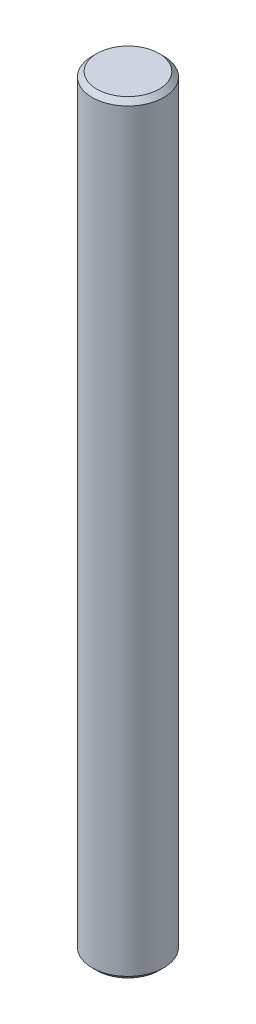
ISO-10303-21;
HEADER;
FILE_DESCRIPTION(('STEP AP214'),'2;1');
FILE_NAME('part.step','',(''),(''),'','','');
FILE_SCHEMA(('AUTOMOTIVE_DESIGN { 1 0 10303 214 1 1 1 1 }'));
ENDSEC;
DATA;
#1=APPLICATION_CONTEXT('core data for automotive mechanical design processes');
#2=APPLICATION_PROTOCOL_DEFINITION('international standard','automotive_design',2000,#1);
#3=PRODUCT_CONTEXT('',#1,'mechanical');
#4=PRODUCT('Part','Part','',(#3));
#5=PRODUCT_RELATED_PRODUCT_CATEGORY('part','',(#4));
#6=PRODUCT_DEFINITION_FORMATION('','',#4);
#7=PRODUCT_DEFINITION_CONTEXT('part definition',#1,'design');
#8=PRODUCT_DEFINITION('design','',#6,#7);
#9=PRODUCT_DEFINITION_SHAPE('','',#8);
#10=(LENGTH_UNIT() NAMED_UNIT(*) SI_UNIT(.MILLI.,.METRE.));
#11=(NAMED_UNIT(*) PLANE_ANGLE_UNIT() SI_UNIT($,.RADIAN.));
#12=(NAMED_UNIT(*) SI_UNIT($,.STERADIAN.) SOLID_ANGLE_UNIT());
#13=UNCERTAINTY_MEASURE_WITH_UNIT(LENGTH_MEASURE(1.E-05),#10,'distance_accuracy_value','');
#14=(GEOMETRIC_REPRESENTATION_CONTEXT(3) GLOBAL_UNCERTAINTY_ASSIGNED_CONTEXT((#13)) GLOBAL_UNIT_ASSIGNED_CONTEXT((#10,
#11,#12)) REPRESENTATION_CONTEXT('',''));
#15=CARTESIAN_POINT('',(0.,0.,0.));
#16=DIRECTION('',(0.,0.,1.));
#17=DIRECTION('',(1.,0.,0.));
#18=AXIS2_PLACEMENT_3D('',#15,#16,#17);
#19=CARTESIAN_POINT('',(0.,8.,0.));
#20=DIRECTION('',(0.,-1.,0.));
#21=DIRECTION('',(0.,0.,-1.));
#22=AXIS2_PLACEMENT_3D('',#19,#20,#21);
#23=CYLINDRICAL_SURFACE('',#22,0.75);
#24=CARTESIAN_POINT('',(0.,-7.9,0.));
#25=DIRECTION('',(0.,1.,0.));
#26=DIRECTION('',(0.,0.,1.));
#27=AXIS2_PLACEMENT_3D('',#24,#25,#26);
#28=CIRCLE('',#27,0.75);
#29=CARTESIAN_POINT('',(0.,-7.9,0.75));
#30=VERTEX_POINT('',#29);
#31=EDGE_CURVE('E40',#30,#30,#28,.T.);
#32=ORIENTED_EDGE('',*,*,#31,.T.);
#33=EDGE_LOOP('',(#32));
#34=FACE_BOUND('',#33,.T.);
#35=CARTESIAN_POINT('',(0.,7.9,0.));
#36=DIRECTION('',(0.,1.,0.));
#37=DIRECTION('',(0.,0.,1.));
#38=AXIS2_PLACEMENT_3D('',#35,#36,#37);
#39=CIRCLE('',#38,0.75);
#40=CARTESIAN_POINT('',(0.,7.9,0.75));
#41=VERTEX_POINT('',#40);
#42=EDGE_CURVE('E44',#41,#41,#39,.F.);
#43=ORIENTED_EDGE('',*,*,#42,.T.);
#44=EDGE_LOOP('',(#43));
#45=FACE_BOUND('',#44,.T.);
#46=ADVANCED_FACE('F29',(#34,#45),#23,.T.);
#47=CARTESIAN_POINT('',(0.,8.,0.));
#48=DIRECTION('',(0.,1.,0.));
#49=DIRECTION('',(0.,0.,1.));
#50=AXIS2_PLACEMENT_3D('',#47,#48,#49);
#51=PLANE('',#50);
#52=CARTESIAN_POINT('',(0.,8.,0.));
#53=DIRECTION('',(0.,1.,0.));
#54=DIRECTION('',(0.,0.,1.));
#55=AXIS2_PLACEMENT_3D('',#52,#53,#54);
#56=CIRCLE('',#55,0.650000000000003);
#57=CARTESIAN_POINT('',(0.,8.,0.650000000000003));
#58=VERTEX_POINT('',#57);
#59=EDGE_CURVE('E10',#58,#58,#56,.T.);
#60=ORIENTED_EDGE('',*,*,#59,.T.);
#61=EDGE_LOOP('',(#60));
#62=FACE_BOUND('',#61,.T.);
#63=ADVANCED_FACE('F60',(#62),#51,.T.);
#64=CARTESIAN_POINT('',(0.,-8.,0.));
#65=DIRECTION('',(0.,1.,0.));
#66=DIRECTION('',(0.,0.,1.));
#67=AXIS2_PLACEMENT_3D('',#64,#65,#66);
#68=PLANE('',#67);
#69=CARTESIAN_POINT('',(0.,-8.,0.));
#70=DIRECTION('',(0.,1.,0.));
#71=DIRECTION('',(0.,0.,1.));
#72=AXIS2_PLACEMENT_3D('',#69,#70,#71);
#73=CIRCLE('',#72,0.650000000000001);
#74=CARTESIAN_POINT('',(0.,-8.,0.650000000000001));
#75=VERTEX_POINT('',#74);
#76=EDGE_CURVE('E36',#75,#75,#73,.F.);
#77=ORIENTED_EDGE('',*,*,#76,.T.);
#78=EDGE_LOOP('',(#77));
#79=FACE_BOUND('',#78,.T.);
#80=ADVANCED_FACE('F57',(#79),#68,.F.);
#81=CARTESIAN_POINT('',(0.,-7.9,0.));
#82=DIRECTION('',(0.,1.,0.));
#83=DIRECTION('',(0.,0.,1.));
#84=AXIS2_PLACEMENT_3D('',#81,#82,#83);
#85=CONICAL_SURFACE('',#84,0.75,0.785398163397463);
#86=ORIENTED_EDGE('',*,*,#76,.F.);
#87=EDGE_LOOP('',(#86));
#88=FACE_BOUND('',#87,.T.);
#89=ORIENTED_EDGE('',*,*,#31,.F.);
#90=EDGE_LOOP('',(#89));
#91=FACE_BOUND('',#90,.T.);
#92=ADVANCED_FACE('F53',(#88,#91),#85,.T.);
#93=CARTESIAN_POINT('',(0.,8.,0.));
#94=DIRECTION('',(0.,-1.,0.));
#95=DIRECTION('',(0.,0.,-1.));
#96=AXIS2_PLACEMENT_3D('',#93,#94,#95);
#97=CONICAL_SURFACE('',#96,0.650000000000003,0.785398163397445);
#98=ORIENTED_EDGE('',*,*,#42,.F.);
#99=EDGE_LOOP('',(#98));
#100=FACE_BOUND('',#99,.T.);
#101=ORIENTED_EDGE('',*,*,#59,.F.);
#102=EDGE_LOOP('',(#101));
#103=FACE_BOUND('',#102,.T.);
#104=ADVANCED_FACE('F31',(#100,#103),#97,.T.);
#105=CLOSED_SHELL('',(#46,#63,#80,#92,#104));
#106=MANIFOLD_SOLID_BREP('B2',#105);
#107=ADVANCED_BREP_SHAPE_REPRESENTATION('',(#18,#106),#14);
#108=SHAPE_DEFINITION_REPRESENTATION(#9,#107);
ENDSEC;
END-ISO-10303-21;
